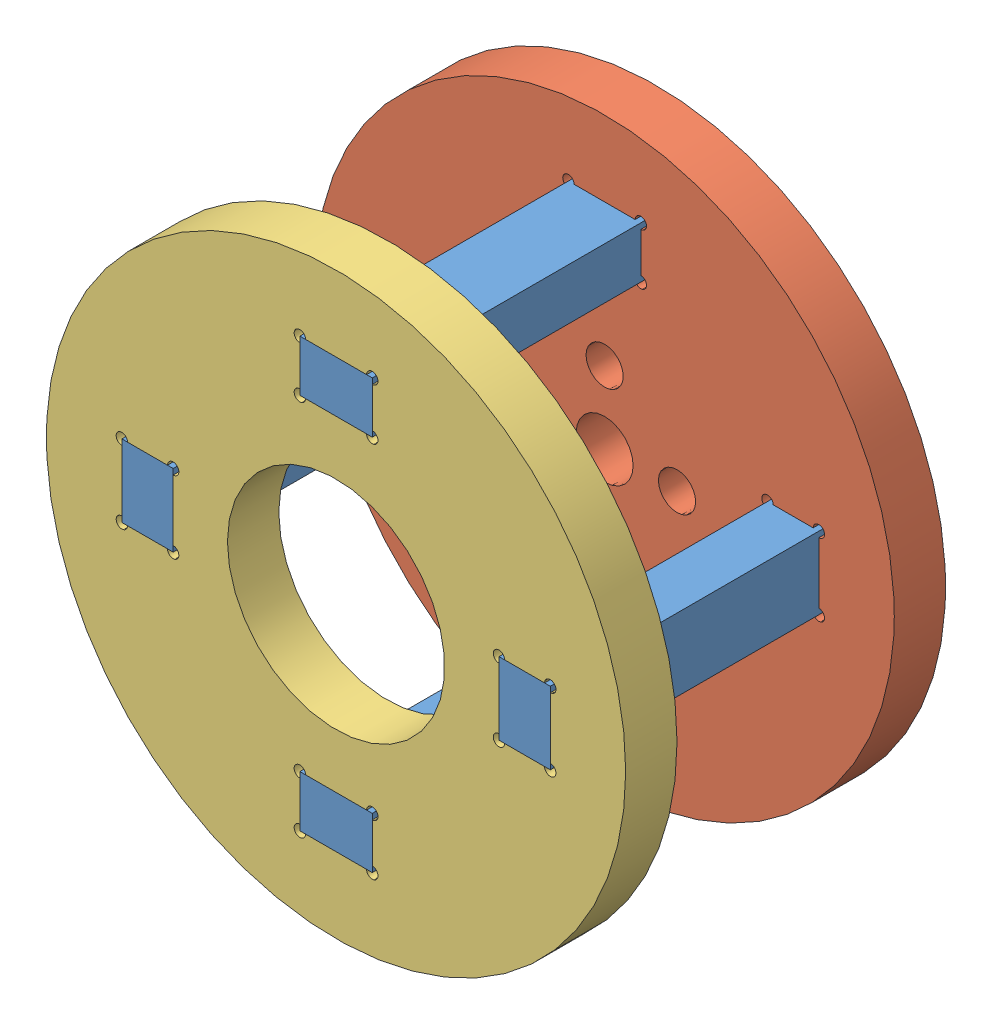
SolidWorks assembly PulleyAssembly.SLDASM, configuration Default (file format 8000). Lengths in mm.
Overall size (50.8 50.8 28.05).
6 component instances, 3 part files, 15 mates.
Components (placement in the parent):
- Puller Spacer-1: Puller Spacer.SLDPRT [Default] at (28.0117 52.3155 10.534) x (0 0 1) z (0 -1 0) size (28.05 4.5 6.35)
- Pulley Inner-1: Pulley Inner.SLDPRT [Default] at (9.2282 49.1405 10.534) size (50.8 50.8 4.5)
- Puller Spacer-2: Puller Spacer.SLDPRT [Default] at (12.4032 30.3569 10.534) x (0 0 1) z (-1 0 0) size (28.05 4.5 6.35)
- Puller Spacer-3: Puller Spacer.SLDPRT [Default] at (12.4032 63.4241 10.534) x (0 0 1) z (-1 0 0) size (28.05 4.5 6.35)
- Puller Spacer-4: Puller Spacer.SLDPRT [Default] at (-9.5554 45.9655 10.534) x (0 0 1) z (0 1 0) size (28.05 4.5 6.35)
- Pulley OuterFillet-1: Pulley OuterFillet.SLDPRT [Default] at (9.2282 49.1405 38.584) x (-1 0 0) z (0 0 -1) size (50.8 50.8 4.5)
Mates (geometry in assembly coordinates):
- Coincident2: coincident anti-aligned: plane of Puller Spacer-3 through (6.0532 67.9241 10.534) normal (0 1 0); plane of Pulley OuterFillet-1 through (9.2282 67.9241 38.584) normal (0 -1 0)
- Coincident3: coincident anti-aligned: plane of Puller Spacer-3 through (12.4032 63.4241 10.534) normal (1 0 0); plane of Pulley OuterFillet-1 through (12.4032 49.1405 38.584) normal (-1 0 0)
- Coincident4: coincident aligned: plane of Puller Spacer-3 through (6.0532 63.4241 38.584) normal (0 0 1); plane of Pulley OuterFillet-1 through (9.2282 49.1405 38.584) normal (0 0 1)
- Coincident6: coincident aligned: plane of Puller Spacer-2 through (6.0532 30.3569 38.584) normal (0 0 1); plane of Pulley OuterFillet-1 through (9.2282 49.1405 38.584) normal (0 0 1)
- Coincident7: coincident anti-aligned: plane of Puller Spacer-2 through (6.0532 30.3569 10.534) normal (-1 0 0); plane of Pulley OuterFillet-1 through (6.0532 49.1405 38.584) normal (1 0 0)
- Coincident8: coincident anti-aligned: plane of Puller Spacer-2 through (6.0532 34.8569 10.534) normal (0 1 0); plane of Pulley OuterFillet-1 through (9.2282 34.8569 38.584) normal (0 -1 0)
- Coincident9: coincident aligned: plane of Puller Spacer-4 through (-9.5554 52.3155 38.584) normal (0 0 1); plane of Pulley OuterFillet-1 through (9.2282 49.1405 38.584) normal (0 0 1)
- Coincident10: coincident anti-aligned: plane of Puller Spacer-4 through (-9.5554 52.3155 10.534) normal (-1 0 0); plane of Pulley OuterFillet-1 through (-9.5554 49.1405 38.584) normal (1 0 0)
- Coincident11: coincident anti-aligned: plane of Puller Spacer-4 through (-9.5554 52.3155 10.534) normal (0 1 0); plane of Pulley OuterFillet-1 through (9.2282 52.3155 38.584) normal (0 -1 0)
- Coincident12: coincident aligned: plane of Puller Spacer-1 through (28.0117 45.9655 38.584) normal (0 0 1); plane of Pulley OuterFillet-1 through (9.2282 49.1405 38.584) normal (0 0 1)
- Coincident13: coincident anti-aligned: plane of Puller Spacer-1 through (23.5117 45.9655 10.534) normal (-1 0 0); plane of Pulley OuterFillet-1 through (23.5117 49.1405 38.584) normal (1 0 0)
- Coincident14: coincident anti-aligned: plane of Puller Spacer-1 through (28.0117 52.3155 10.534) normal (0 1 0); plane of Pulley OuterFillet-1 through (9.2282 52.3155 38.584) normal (0 -1 0)
- Coincident15: coincident aligned: plane of Pulley Inner-1 through (9.2282 49.1405 10.534) normal (0 0 -1); plane of Puller Spacer-3 through (6.0532 63.4241 10.534) normal (0 0 -1)
- Coincident16: coincident anti-aligned: plane of Pulley Inner-1 through (9.2282 67.9241 10.534) normal (0 -1 0); plane of Puller Spacer-3 through (6.0532 67.9241 10.534) normal (0 1 0)
- Coincident17: coincident anti-aligned: plane of Pulley Inner-1 through (12.4032 49.1405 10.534) normal (-1 0 0); plane of Puller Spacer-3 through (12.4032 63.4241 10.534) normal (1 0 0)
